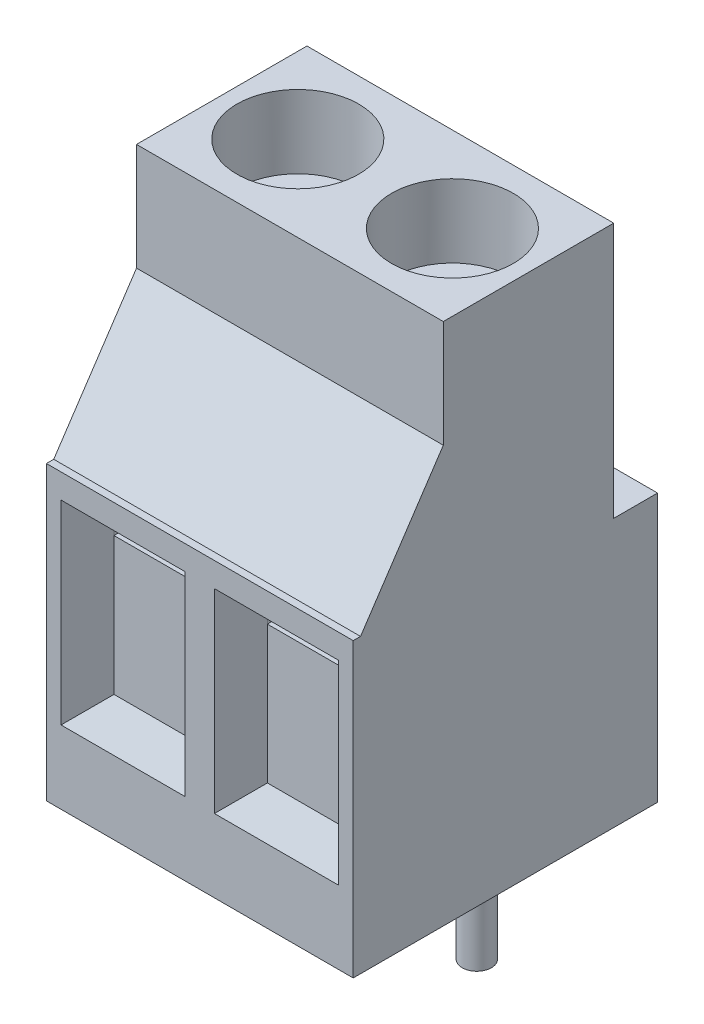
from build123d import *
from build123d.topology import SkipClean

# Parameters (mm, degrees)
SKETCH1_W                    = 12.6
SKETCH1_H                    = 12.5
EXTRUDE1_DEPTH               = 21.5
SKETCH3_W                    = 5.1
SKETCH3_H                    = 8
WIREOPENINGS_DEPTH           = 2
WIREOPENINGS_DRAFT           = -5
WIREOPENINGS_PROFILE_2_DEPTH = 2
WIREOPENINGS_PROFILE_2_DRAFT = -5
PROFILE_DEPTH                = 26.691876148
SKETCH5_R                    = 2.5
TOPSCREWS_DEPTH              = 3
SKETCH6_R                    = 0.6
PINS_DEPTH                   = 5
CUT_EXTRUDE1_DEPTH           = 1
SKETCH9_W                    = 4.750045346
SKETCH9_H                    = 2
CUT_EXTRUDE2_DEPTH           = 8


with BuildPart() as part:
    # Sketch1 → Extrude1 (new body)
    with BuildSketch(Plane(origin=(0, 0, 0), x_dir=(1, 0, 0), z_dir=(0, 1, 0))):
        Rectangle(SKETCH1_W, SKETCH1_H)
    extrude(amount=EXTRUDE1_DEPTH)


with BuildPart() as wireopenings_tool:
    # Sketch3 → WireOpenings (with draft: the straight prism first)
    with BuildSketch(Plane.XY.offset(6.25)):
        with Locations((-3.15, 7)):
            Rectangle(SKETCH3_W, SKETCH3_H)
    extrude(amount=-WIREOPENINGS_DEPTH)
    # WireOpenings: the draft: its side faces are tilted about the plane it starts from
    wireopenings_sides = [wireopenings_tool.faces().sort_by_distance(p)[0] for p in [
        (-0.6, 7, 5.25),
        (-3.15, 11, 5.25),
        (-5.7, 7, 5.25),
        (-3.15, 3, 5.25),
    ]]
    draft(wireopenings_sides, Plane.XY.offset(6.25), WIREOPENINGS_DRAFT)


with BuildPart() as part_1:
    add(part.part)

    # WireOpenings: cut by wireopenings_tool
    add(wireopenings_tool.part, mode=Mode.SUBTRACT)


with BuildPart() as wireopenings_profile_2_tool:
    # Sketch3 → WireOpenings profile 2 (with draft: the straight prism first)
    with BuildSketch(Plane.XY.offset(6.25)):
        with Locations((3.15, 7)):
            Rectangle(SKETCH3_W, SKETCH3_H)
    extrude(amount=-WIREOPENINGS_PROFILE_2_DEPTH)
    # WireOpenings profile 2: the draft: its side faces are tilted about the plane it starts from
    wireopenings_profile_2_sides = [wireopenings_profile_2_tool.faces().sort_by_distance(p)[0] for p in [
        (5.7, 7, 5.25),
        (3.15, 11, 5.25),
        (0.6, 7, 5.25),
        (3.15, 3, 5.25),
    ]]
    draft(wireopenings_profile_2_sides, Plane.XY.offset(6.25), WIREOPENINGS_PROFILE_2_DRAFT)


with BuildPart() as part_2:
    add(part_1.part)

    # WireOpenings profile 2: cut by wireopenings_profile_2_tool
    add(wireopenings_profile_2_tool.part, mode=Mode.SUBTRACT)

    # Sketch4 → Profile (cut, through all)
    with BuildSketch(Plane(origin=(6.3, 0, 0), x_dir=(0, 0, -1), z_dir=(1, 0, 0))):
        Polygon((-7.703020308, 12), (-5.95, 12), (-2.55, 17.1), (-2.55, 22.334011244), (4.45, 22.334011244), (4.45, 11), (8.106648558, 11), (8.106648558, 23.531490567), (-7.703020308, 23.531490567), align=None)
    extrude(amount=-PROFILE_DEPTH, mode=Mode.SUBTRACT)

    # Sketch5 → TopScrews (cut)
    with BuildSketch(Plane(origin=(0, 21.5, 0), x_dir=(-1, 0, 0), z_dir=(0, 1, 0))):
        with Locations(Location((-3.175, -0.95, 0), (0, 0, 90))):
            Circle(SKETCH5_R)
        with Locations(Location((3.175, -0.95, 0), (0, 0, 270))):
            Circle(SKETCH5_R)
    extrude(amount=-TOPSCREWS_DEPTH, mode=Mode.SUBTRACT)

    # Sketch6 → Pins (add)
    with BuildSketch(Plane.XZ):
        with Locations(Location((-3.175, -1.95, 0), (0, 0, 90))):
            Circle(SKETCH6_R)
        with Locations(Location((3.175, -1.95, 0), (0, 0, 90))):
            Circle(SKETCH6_R)
    extrude(amount=PINS_DEPTH)

    # Sketch7 → Cut-Extrude1 (cut)
    with BuildSketch(Plane(origin=(0, 18.5, 0), x_dir=(1, 0, 0), z_dir=(0, 1, 0))):
        with BuildLine():
            Line((-3.675, 3.399489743), (-3.675, -1.499489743))
            ThreePointArc((-3.675, -1.499489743), (-3.175, -1.55), (-2.675, -1.499489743))
            Line((-2.675, -1.499489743), (-2.675, 3.399489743))
            ThreePointArc((-2.675, 3.399489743), (-3.175, 3.45), (-3.675, 3.399489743))
        make_face()
    cut_extrude1 = extrude(amount=-CUT_EXTRUDE1_DEPTH, mode=Mode.SUBTRACT)

    # Mirror1: Cut-Extrude1 across plane
    with SkipClean():  # the faces are left unmerged after this step: merging them gives an invalid solid
        add(cut_extrude1.mirror(Plane(origin=(0, 0, 0), x_dir=(0, 0, 1), z_dir=(1, 0, 0))), mode=Mode.SUBTRACT)

    # Sketch9 → Cut-Extrude2 (cut)
    with SkipClean():  # the faces are left unmerged after this step: merging them gives an invalid solid
        with BuildSketch(Plane.XY.offset(4.25)):
            with Locations((-3.15, 9.825022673)):
                Rectangle(SKETCH9_W, SKETCH9_H)
        cut_extrude2 = extrude(amount=-CUT_EXTRUDE2_DEPTH, mode=Mode.SUBTRACT)

    # Mirror2: Cut-Extrude2 across plane
    with SkipClean():  # the faces are left unmerged after this step: merging them gives an invalid solid
        add(cut_extrude2.mirror(Plane(origin=(0, 0, 0), x_dir=(0, 0, 1), z_dir=(1, 0, 0))), mode=Mode.SUBTRACT)


solid = part_2.part
